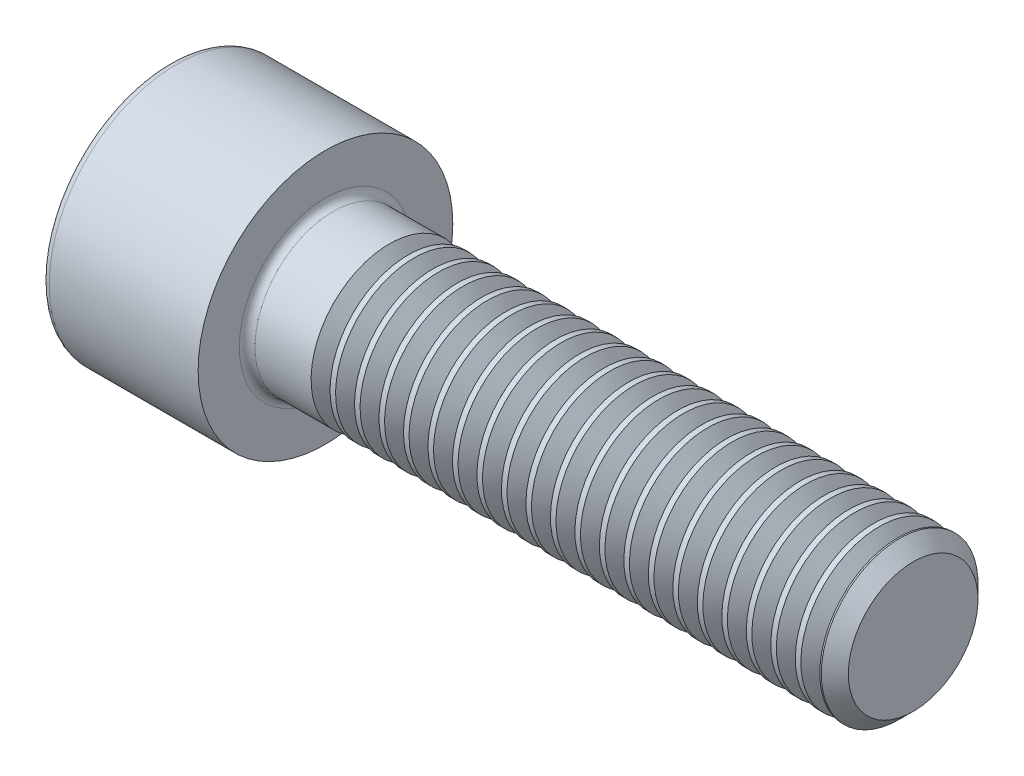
from build123d import *

# Parameters (mm, degrees)
FILLET1_R       = 0.4
FILLET2_R       = 0.4
HEX_2_DEPTH     = 4
THDSCHPAT_COUNT = 21
THDSCHPAT_PITCH = 1.25


with BuildPart() as part:
    # BodySke → Base-Revolve (revolve)
    with BuildSketch(Plane.XY, mode=Mode.PRIVATE) as base_revolve_sk:
        Polygon((0, 0), (0, 6.5), (8, 6.5), (8, 4), (37.3095, 4), (38, 3.3095), (38, 0), align=None)
    revolve(base_revolve_sk.sketch.rotate(Axis((-31.75, 0, 0), (1, 0, 0)), 90), axis=Axis((-31.75, 0, 0), (1, 0, 0)))

    # Fillet1
    fillet1_edges = [part.edges().sort_by_distance(p)[0] for p in [
        (8, 0, -4),
    ]]
    fillet(fillet1_edges, radius=FILLET1_R)

    # Fillet2
    fillet2_edges = [part.edges().sort_by_distance(p)[0] for p in [
        (0, 0, -6.5),
    ]]
    fillet(fillet2_edges, radius=FILLET2_R)

    # Sketch2 → Hex-PreBroach (revolve, cut)
    with BuildSketch(Plane.XY, mode=Mode.PRIVATE) as hex_prebroach_sk:
        Polygon((0, 3.0475), (4, 3.0475), (5.759474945, 0), (0, 0), align=None)
    revolve(hex_prebroach_sk.sketch.rotate(Axis((0, 0, 0), (1, 0, 0)), 90), axis=Axis((0, 0, 0), (1, 0, 0)), mode=Mode.SUBTRACT)

    # Sketch3 → Hex 2 (cut)
    with BuildSketch(Plane(origin=(0, 0, 0), x_dir=(0, 0.500000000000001, 0.866025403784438), z_dir=(-1, 0, 0))):
        Polygon((1.759474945, 3.0475), (-1.759474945, 3.0475), (-3.518949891, 0), (-1.759474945, -3.0475), (1.759474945, -3.0475), (3.518949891, 0), align=None)
    extrude(amount=-HEX_2_DEPTH, mode=Mode.SUBTRACT)

    # ThdSchSke → ThreadSchematic (revolve, cut)
    with BuildSketch(Plane.XY):
        Polygon((11.75, -3.3095), (11.266506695, -4), (11.266506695, -5), (12.233493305, -5), (12.233493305, -4), align=None)
    threadschematic = revolve(axis=Axis((-3.175, 0, 0), (1, 0, 0)), mode=Mode.SUBTRACT)

    # ThdSchPat: ThreadSchematic ×21
    with Locations(*[(i * THDSCHPAT_PITCH, 0, 0) for i in range(1, THDSCHPAT_COUNT)]):
        add(threadschematic, mode=Mode.SUBTRACT)


solid = part.part
